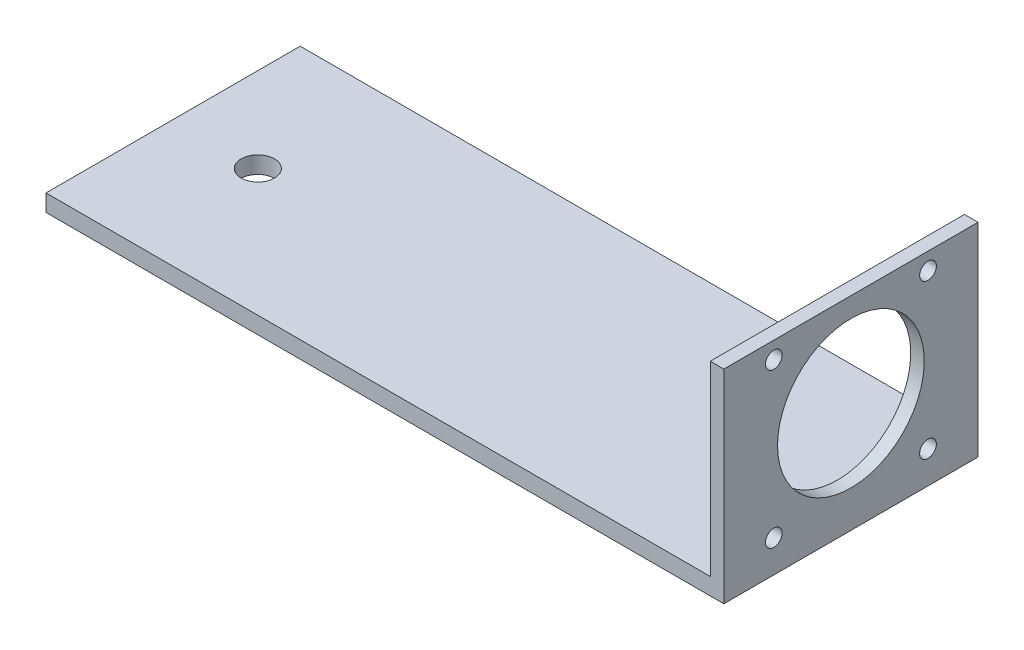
ISO-10303-21;
HEADER;
FILE_DESCRIPTION(('STEP AP214'),'2;1');
FILE_NAME('part.step','',(''),(''),'','','');
FILE_SCHEMA(('AUTOMOTIVE_DESIGN { 1 0 10303 214 1 1 1 1 }'));
ENDSEC;
DATA;
#1=APPLICATION_CONTEXT('core data for automotive mechanical design processes');
#2=APPLICATION_PROTOCOL_DEFINITION('international standard','automotive_design',2000,#1);
#3=PRODUCT_CONTEXT('',#1,'mechanical');
#4=PRODUCT('Part','Part','',(#3));
#5=PRODUCT_RELATED_PRODUCT_CATEGORY('part','',(#4));
#6=PRODUCT_DEFINITION_FORMATION('','',#4);
#7=PRODUCT_DEFINITION_CONTEXT('part definition',#1,'design');
#8=PRODUCT_DEFINITION('design','',#6,#7);
#9=PRODUCT_DEFINITION_SHAPE('','',#8);
#10=(LENGTH_UNIT() NAMED_UNIT(*) SI_UNIT(.MILLI.,.METRE.));
#11=(NAMED_UNIT(*) PLANE_ANGLE_UNIT() SI_UNIT($,.RADIAN.));
#12=(NAMED_UNIT(*) SI_UNIT($,.STERADIAN.) SOLID_ANGLE_UNIT());
#13=UNCERTAINTY_MEASURE_WITH_UNIT(LENGTH_MEASURE(1.E-05),#10,'distance_accuracy_value','');
#14=(GEOMETRIC_REPRESENTATION_CONTEXT(3) GLOBAL_UNCERTAINTY_ASSIGNED_CONTEXT((#13)) GLOBAL_UNIT_ASSIGNED_CONTEXT((#10,
#11,#12)) REPRESENTATION_CONTEXT('',''));
#15=CARTESIAN_POINT('',(0.,0.,0.));
#16=DIRECTION('',(0.,0.,1.));
#17=DIRECTION('',(1.,0.,0.));
#18=AXIS2_PLACEMENT_3D('',#15,#16,#17);
#19=CARTESIAN_POINT('',(0.,2.54,0.));
#20=DIRECTION('',(1.,0.,0.));
#21=DIRECTION('',(0.,0.,-1.));
#22=AXIS2_PLACEMENT_3D('',#19,#20,#21);
#23=PLANE('',#22);
#24=DIRECTION('',(0.,0.,1.));
#25=VECTOR('',#24,1.);
#26=CARTESIAN_POINT('',(0.,0.,0.));
#27=LINE('',#26,#25);
#28=CARTESIAN_POINT('',(0.,0.,-38.1));
#29=VERTEX_POINT('',#28);
#30=CARTESIAN_POINT('',(0.,0.,0.));
#31=VERTEX_POINT('',#30);
#32=EDGE_CURVE('E120',#29,#31,#27,.T.);
#33=ORIENTED_EDGE('',*,*,#32,.T.);
#34=DIRECTION('',(0.,-1.,0.));
#35=VECTOR('',#34,1.);
#36=CARTESIAN_POINT('',(0.,2.54,0.));
#37=LINE('',#36,#35);
#38=CARTESIAN_POINT('',(0.,2.54,0.));
#39=VERTEX_POINT('',#38);
#40=EDGE_CURVE('E11',#39,#31,#37,.T.);
#41=ORIENTED_EDGE('',*,*,#40,.F.);
#42=DIRECTION('',(0.,0.,1.));
#43=VECTOR('',#42,1.);
#44=CARTESIAN_POINT('',(0.,2.54,0.));
#45=LINE('',#44,#43);
#46=CARTESIAN_POINT('',(0.,2.54,-38.1));
#47=VERTEX_POINT('',#46);
#48=EDGE_CURVE('E121',#47,#39,#45,.T.);
#49=ORIENTED_EDGE('',*,*,#48,.F.);
#50=DIRECTION('',(0.,-1.,0.));
#51=VECTOR('',#50,1.);
#52=CARTESIAN_POINT('',(0.,2.54,-38.1));
#53=LINE('',#52,#51);
#54=EDGE_CURVE('E126',#47,#29,#53,.T.);
#55=ORIENTED_EDGE('',*,*,#54,.T.);
#56=EDGE_LOOP('',(#33,#41,#49,#55));
#57=FACE_BOUND('',#56,.T.);
#58=ADVANCED_FACE('F39',(#57),#23,.F.);
#59=CARTESIAN_POINT('',(0.,2.54,0.));
#60=DIRECTION('',(0.,0.,-1.));
#61=DIRECTION('',(-1.,0.,0.));
#62=AXIS2_PLACEMENT_3D('',#59,#60,#61);
#63=PLANE('',#62);
#64=DIRECTION('',(1.,0.,0.));
#65=VECTOR('',#64,1.);
#66=CARTESIAN_POINT('',(0.,0.,0.));
#67=LINE('',#66,#65);
#68=CARTESIAN_POINT('',(101.6,0.,0.));
#69=VERTEX_POINT('',#68);
#70=EDGE_CURVE('E129',#31,#69,#67,.T.);
#71=ORIENTED_EDGE('',*,*,#70,.T.);
#72=DIRECTION('',(0.,-1.,0.));
#73=VECTOR('',#72,1.);
#74=CARTESIAN_POINT('',(101.6,2.54,0.));
#75=LINE('',#74,#73);
#76=CARTESIAN_POINT('',(101.6,30.48,0.));
#77=VERTEX_POINT('',#76);
#78=EDGE_CURVE('E46',#77,#69,#75,.T.);
#79=ORIENTED_EDGE('',*,*,#78,.F.);
#80=DIRECTION('',(1.,0.,0.));
#81=VECTOR('',#80,1.);
#82=CARTESIAN_POINT('',(99.568,30.48,0.));
#83=LINE('',#82,#81);
#84=CARTESIAN_POINT('',(99.568,30.48,0.));
#85=VERTEX_POINT('',#84);
#86=EDGE_CURVE('E108',#85,#77,#83,.T.);
#87=ORIENTED_EDGE('',*,*,#86,.F.);
#88=DIRECTION('',(0.,-1.,0.));
#89=VECTOR('',#88,1.);
#90=CARTESIAN_POINT('',(99.568,0.,0.));
#91=LINE('',#90,#89);
#92=CARTESIAN_POINT('',(99.568,2.54,0.));
#93=VERTEX_POINT('',#92);
#94=EDGE_CURVE('E100',#85,#93,#91,.T.);
#95=ORIENTED_EDGE('',*,*,#94,.T.);
#96=DIRECTION('',(1.,0.,0.));
#97=VECTOR('',#96,1.);
#98=CARTESIAN_POINT('',(0.,2.54,0.));
#99=LINE('',#98,#97);
#100=EDGE_CURVE('E58',#39,#93,#99,.T.);
#101=ORIENTED_EDGE('',*,*,#100,.F.);
#102=ORIENTED_EDGE('',*,*,#40,.T.);
#103=EDGE_LOOP('',(#71,#79,#87,#95,#101,#102));
#104=FACE_BOUND('',#103,.T.);
#105=ADVANCED_FACE('F163',(#104),#63,.F.);
#106=CARTESIAN_POINT('',(101.6,2.54,0.));
#107=DIRECTION('',(-1.,0.,0.));
#108=DIRECTION('',(0.,0.,1.));
#109=AXIS2_PLACEMENT_3D('',#106,#107,#108);
#110=PLANE('',#109);
#111=CARTESIAN_POINT('',(101.6,4.826,-30.607));
#112=DIRECTION('',(-1.,0.,0.));
#113=DIRECTION('',(0.,0.,1.));
#114=AXIS2_PLACEMENT_3D('',#111,#112,#113);
#115=CIRCLE('',#114,1.24968);
#116=CARTESIAN_POINT('',(101.6,4.826,-29.35732));
#117=VERTEX_POINT('',#116);
#118=EDGE_CURVE('E192',#117,#117,#115,.F.);
#119=ORIENTED_EDGE('',*,*,#118,.F.);
#120=EDGE_LOOP('',(#119));
#121=FACE_BOUND('',#120,.T.);
#122=CARTESIAN_POINT('',(101.6,4.826,-7.493));
#123=DIRECTION('',(-1.,0.,0.));
#124=DIRECTION('',(0.,0.,1.));
#125=AXIS2_PLACEMENT_3D('',#122,#123,#124);
#126=CIRCLE('',#125,1.24968);
#127=CARTESIAN_POINT('',(101.6,4.826,-6.24332));
#128=VERTEX_POINT('',#127);
#129=EDGE_CURVE('E199',#128,#128,#126,.F.);
#130=ORIENTED_EDGE('',*,*,#129,.F.);
#131=EDGE_LOOP('',(#130));
#132=FACE_BOUND('',#131,.T.);
#133=CARTESIAN_POINT('',(101.6,27.94,-7.493));
#134=DIRECTION('',(-1.,0.,0.));
#135=DIRECTION('',(0.,0.,1.));
#136=AXIS2_PLACEMENT_3D('',#133,#134,#135);
#137=CIRCLE('',#136,1.24968);
#138=CARTESIAN_POINT('',(101.6,27.94,-6.24332));
#139=VERTEX_POINT('',#138);
#140=EDGE_CURVE('E191',#139,#139,#137,.F.);
#141=ORIENTED_EDGE('',*,*,#140,.F.);
#142=EDGE_LOOP('',(#141));
#143=FACE_BOUND('',#142,.T.);
#144=CARTESIAN_POINT('',(101.6,27.94,-30.607));
#145=DIRECTION('',(-1.,0.,0.));
#146=DIRECTION('',(0.,0.,1.));
#147=AXIS2_PLACEMENT_3D('',#144,#145,#146);
#148=CIRCLE('',#147,1.24968);
#149=CARTESIAN_POINT('',(101.6,27.94,-29.35732));
#150=VERTEX_POINT('',#149);
#151=EDGE_CURVE('E183',#150,#150,#148,.F.);
#152=ORIENTED_EDGE('',*,*,#151,.F.);
#153=EDGE_LOOP('',(#152));
#154=FACE_BOUND('',#153,.T.);
#155=CARTESIAN_POINT('',(101.6,16.51,-19.05));
#156=DIRECTION('',(-1.,0.,0.));
#157=DIRECTION('',(0.,0.,1.));
#158=AXIS2_PLACEMENT_3D('',#155,#156,#157);
#159=CIRCLE('',#158,10.9982);
#160=CARTESIAN_POINT('',(101.6,16.51,-8.0518));
#161=VERTEX_POINT('',#160);
#162=EDGE_CURVE('E117',#161,#161,#159,.T.);
#163=ORIENTED_EDGE('',*,*,#162,.T.);
#164=EDGE_LOOP('',(#163));
#165=FACE_BOUND('',#164,.T.);
#166=DIRECTION('',(0.,0.,-1.));
#167=VECTOR('',#166,1.);
#168=CARTESIAN_POINT('',(101.6,0.,0.));
#169=LINE('',#168,#167);
#170=CARTESIAN_POINT('',(101.6,0.,-38.1));
#171=VERTEX_POINT('',#170);
#172=EDGE_CURVE('E131',#69,#171,#169,.T.);
#173=ORIENTED_EDGE('',*,*,#172,.T.);
#174=DIRECTION('',(0.,-1.,0.));
#175=VECTOR('',#174,1.);
#176=CARTESIAN_POINT('',(101.6,2.54,-38.1));
#177=LINE('',#176,#175);
#178=CARTESIAN_POINT('',(101.6,30.48,-38.1));
#179=VERTEX_POINT('',#178);
#180=EDGE_CURVE('E136',#179,#171,#177,.T.);
#181=ORIENTED_EDGE('',*,*,#180,.F.);
#182=DIRECTION('',(0.,0.,1.));
#183=VECTOR('',#182,1.);
#184=CARTESIAN_POINT('',(101.6,30.48,0.));
#185=LINE('',#184,#183);
#186=EDGE_CURVE('E107',#179,#77,#185,.T.);
#187=ORIENTED_EDGE('',*,*,#186,.T.);
#188=ORIENTED_EDGE('',*,*,#78,.T.);
#189=EDGE_LOOP('',(#173,#181,#187,#188));
#190=FACE_BOUND('',#189,.T.);
#191=ADVANCED_FACE('F140',(#121,#132,#143,#154,#165,#190),#110,.F.);
#192=CARTESIAN_POINT('',(0.,2.54,-38.1));
#193=DIRECTION('',(0.,0.,1.));
#194=DIRECTION('',(1.,0.,0.));
#195=AXIS2_PLACEMENT_3D('',#192,#193,#194);
#196=PLANE('',#195);
#197=DIRECTION('',(-1.,0.,0.));
#198=VECTOR('',#197,1.);
#199=CARTESIAN_POINT('',(0.,2.54,-38.1));
#200=LINE('',#199,#198);
#201=CARTESIAN_POINT('',(99.568,2.54,-38.1));
#202=VERTEX_POINT('',#201);
#203=EDGE_CURVE('E96',#202,#47,#200,.T.);
#204=ORIENTED_EDGE('',*,*,#203,.F.);
#205=DIRECTION('',(0.,1.,0.));
#206=VECTOR('',#205,1.);
#207=CARTESIAN_POINT('',(99.568,0.,-38.1));
#208=LINE('',#207,#206);
#209=CARTESIAN_POINT('',(99.568,30.48,-38.1));
#210=VERTEX_POINT('',#209);
#211=EDGE_CURVE('E89',#202,#210,#208,.T.);
#212=ORIENTED_EDGE('',*,*,#211,.T.);
#213=DIRECTION('',(1.,0.,0.));
#214=VECTOR('',#213,1.);
#215=CARTESIAN_POINT('',(99.568,30.48,-38.1));
#216=LINE('',#215,#214);
#217=EDGE_CURVE('E93',#210,#179,#216,.T.);
#218=ORIENTED_EDGE('',*,*,#217,.T.);
#219=ORIENTED_EDGE('',*,*,#180,.T.);
#220=DIRECTION('',(-1.,0.,0.));
#221=VECTOR('',#220,1.);
#222=CARTESIAN_POINT('',(0.,0.,-38.1));
#223=LINE('',#222,#221);
#224=EDGE_CURVE('E123',#171,#29,#223,.T.);
#225=ORIENTED_EDGE('',*,*,#224,.T.);
#226=ORIENTED_EDGE('',*,*,#54,.F.);
#227=EDGE_LOOP('',(#204,#212,#218,#219,#225,#226));
#228=FACE_BOUND('',#227,.T.);
#229=ADVANCED_FACE('F91',(#228),#196,.F.);
#230=CARTESIAN_POINT('',(0.,2.54,0.));
#231=DIRECTION('',(0.,-1.,0.));
#232=DIRECTION('',(0.,0.,-1.));
#233=AXIS2_PLACEMENT_3D('',#230,#231,#232);
#234=PLANE('',#233);
#235=CARTESIAN_POINT('',(12.7,2.54,-19.05));
#236=DIRECTION('',(0.,1.,0.));
#237=DIRECTION('',(0.,0.,1.));
#238=AXIS2_PLACEMENT_3D('',#235,#236,#237);
#239=CIRCLE('',#238,2.5);
#240=CARTESIAN_POINT('',(12.7,2.54,-16.55));
#241=VERTEX_POINT('',#240);
#242=EDGE_CURVE('E180',#241,#241,#239,.T.);
#243=ORIENTED_EDGE('',*,*,#242,.F.);
#244=EDGE_LOOP('',(#243));
#245=FACE_BOUND('',#244,.T.);
#246=ORIENTED_EDGE('',*,*,#100,.T.);
#247=DIRECTION('',(0.,0.,-1.));
#248=VECTOR('',#247,1.);
#249=CARTESIAN_POINT('',(99.568,2.54,0.));
#250=LINE('',#249,#248);
#251=EDGE_CURVE('E53',#93,#202,#250,.T.);
#252=ORIENTED_EDGE('',*,*,#251,.T.);
#253=ORIENTED_EDGE('',*,*,#203,.T.);
#254=ORIENTED_EDGE('',*,*,#48,.T.);
#255=EDGE_LOOP('',(#246,#252,#253,#254));
#256=FACE_BOUND('',#255,.T.);
#257=ADVANCED_FACE('F149',(#245,#256),#234,.F.);
#258=CARTESIAN_POINT('',(0.,0.,0.));
#259=DIRECTION('',(0.,-1.,0.));
#260=DIRECTION('',(0.,0.,-1.));
#261=AXIS2_PLACEMENT_3D('',#258,#259,#260);
#262=PLANE('',#261);
#263=CARTESIAN_POINT('',(12.7,0.,-19.05));
#264=DIRECTION('',(0.,1.,0.));
#265=DIRECTION('',(0.,0.,1.));
#266=AXIS2_PLACEMENT_3D('',#263,#264,#265);
#267=CIRCLE('',#266,2.5);
#268=CARTESIAN_POINT('',(12.7,0.,-16.55));
#269=VERTEX_POINT('',#268);
#270=EDGE_CURVE('E177',#269,#269,#267,.T.);
#271=ORIENTED_EDGE('',*,*,#270,.T.);
#272=EDGE_LOOP('',(#271));
#273=FACE_BOUND('',#272,.T.);
#274=ORIENTED_EDGE('',*,*,#32,.F.);
#275=ORIENTED_EDGE('',*,*,#224,.F.);
#276=ORIENTED_EDGE('',*,*,#172,.F.);
#277=ORIENTED_EDGE('',*,*,#70,.F.);
#278=EDGE_LOOP('',(#274,#275,#276,#277));
#279=FACE_BOUND('',#278,.T.);
#280=ADVANCED_FACE('F145',(#273,#279),#262,.T.);
#281=CARTESIAN_POINT('',(99.568,0.,0.));
#282=DIRECTION('',(-1.,0.,0.));
#283=DIRECTION('',(0.,0.,1.));
#284=AXIS2_PLACEMENT_3D('',#281,#282,#283);
#285=PLANE('',#284);
#286=CARTESIAN_POINT('',(99.568,4.826,-30.607));
#287=DIRECTION('',(-1.,0.,0.));
#288=DIRECTION('',(0.,0.,1.));
#289=AXIS2_PLACEMENT_3D('',#286,#287,#288);
#290=CIRCLE('',#289,1.24968);
#291=CARTESIAN_POINT('',(99.568,4.826,-29.35732));
#292=VERTEX_POINT('',#291);
#293=EDGE_CURVE('E196',#292,#292,#290,.T.);
#294=ORIENTED_EDGE('',*,*,#293,.F.);
#295=EDGE_LOOP('',(#294));
#296=FACE_BOUND('',#295,.T.);
#297=CARTESIAN_POINT('',(99.568,4.826,-7.493));
#298=DIRECTION('',(-1.,0.,0.));
#299=DIRECTION('',(0.,0.,1.));
#300=AXIS2_PLACEMENT_3D('',#297,#298,#299);
#301=CIRCLE('',#300,1.24968);
#302=CARTESIAN_POINT('',(99.568,4.826,-6.24332));
#303=VERTEX_POINT('',#302);
#304=EDGE_CURVE('E195',#303,#303,#301,.T.);
#305=ORIENTED_EDGE('',*,*,#304,.F.);
#306=EDGE_LOOP('',(#305));
#307=FACE_BOUND('',#306,.T.);
#308=CARTESIAN_POINT('',(99.568,27.94,-7.493));
#309=DIRECTION('',(-1.,0.,0.));
#310=DIRECTION('',(0.,0.,1.));
#311=AXIS2_PLACEMENT_3D('',#308,#309,#310);
#312=CIRCLE('',#311,1.24968);
#313=CARTESIAN_POINT('',(99.568,27.94,-6.24332));
#314=VERTEX_POINT('',#313);
#315=EDGE_CURVE('E202',#314,#314,#312,.T.);
#316=ORIENTED_EDGE('',*,*,#315,.F.);
#317=EDGE_LOOP('',(#316));
#318=FACE_BOUND('',#317,.T.);
#319=CARTESIAN_POINT('',(99.568,27.94,-30.607));
#320=DIRECTION('',(-1.,0.,0.));
#321=DIRECTION('',(0.,0.,1.));
#322=AXIS2_PLACEMENT_3D('',#319,#320,#321);
#323=CIRCLE('',#322,1.24968);
#324=CARTESIAN_POINT('',(99.568,27.94,-29.35732));
#325=VERTEX_POINT('',#324);
#326=EDGE_CURVE('E188',#325,#325,#323,.T.);
#327=ORIENTED_EDGE('',*,*,#326,.F.);
#328=EDGE_LOOP('',(#327));
#329=FACE_BOUND('',#328,.T.);
#330=CARTESIAN_POINT('',(99.568,16.51,-19.05));
#331=DIRECTION('',(-1.,0.,0.));
#332=DIRECTION('',(0.,0.,1.));
#333=AXIS2_PLACEMENT_3D('',#330,#331,#332);
#334=CIRCLE('',#333,10.9982);
#335=CARTESIAN_POINT('',(99.568,16.51,-8.0518));
#336=VERTEX_POINT('',#335);
#337=EDGE_CURVE('E174',#336,#336,#334,.T.);
#338=ORIENTED_EDGE('',*,*,#337,.F.);
#339=EDGE_LOOP('',(#338));
#340=FACE_BOUND('',#339,.T.);
#341=ORIENTED_EDGE('',*,*,#251,.F.);
#342=ORIENTED_EDGE('',*,*,#94,.F.);
#343=DIRECTION('',(0.,0.,1.));
#344=VECTOR('',#343,1.);
#345=CARTESIAN_POINT('',(99.568,30.48,0.));
#346=LINE('',#345,#344);
#347=EDGE_CURVE('E99',#210,#85,#346,.T.);
#348=ORIENTED_EDGE('',*,*,#347,.F.);
#349=ORIENTED_EDGE('',*,*,#211,.F.);
#350=EDGE_LOOP('',(#341,#342,#348,#349));
#351=FACE_BOUND('',#350,.T.);
#352=ADVANCED_FACE('F111',(#296,#307,#318,#329,#340,#351),#285,.T.);
#353=CARTESIAN_POINT('',(99.568,30.48,0.));
#354=DIRECTION('',(0.,1.,0.));
#355=DIRECTION('',(0.,0.,1.));
#356=AXIS2_PLACEMENT_3D('',#353,#354,#355);
#357=PLANE('',#356);
#358=ORIENTED_EDGE('',*,*,#186,.F.);
#359=ORIENTED_EDGE('',*,*,#217,.F.);
#360=ORIENTED_EDGE('',*,*,#347,.T.);
#361=ORIENTED_EDGE('',*,*,#86,.T.);
#362=EDGE_LOOP('',(#358,#359,#360,#361));
#363=FACE_BOUND('',#362,.T.);
#364=ADVANCED_FACE('F104',(#363),#357,.T.);
#365=CARTESIAN_POINT('',(101.6,16.51,-19.05));
#366=DIRECTION('',(-1.,0.,0.));
#367=DIRECTION('',(0.,0.,1.));
#368=AXIS2_PLACEMENT_3D('',#365,#366,#367);
#369=CYLINDRICAL_SURFACE('',#368,10.9982);
#370=ORIENTED_EDGE('',*,*,#162,.F.);
#371=EDGE_LOOP('',(#370));
#372=FACE_BOUND('',#371,.T.);
#373=ORIENTED_EDGE('',*,*,#337,.T.);
#374=EDGE_LOOP('',(#373));
#375=FACE_BOUND('',#374,.T.);
#376=ADVANCED_FACE('F221',(#372,#375),#369,.F.);
#377=CARTESIAN_POINT('',(12.7,0.,-19.05));
#378=DIRECTION('',(0.,1.,0.));
#379=DIRECTION('',(0.,0.,1.));
#380=AXIS2_PLACEMENT_3D('',#377,#378,#379);
#381=CYLINDRICAL_SURFACE('',#380,2.5);
#382=ORIENTED_EDGE('',*,*,#270,.F.);
#383=EDGE_LOOP('',(#382));
#384=FACE_BOUND('',#383,.T.);
#385=ORIENTED_EDGE('',*,*,#242,.T.);
#386=EDGE_LOOP('',(#385));
#387=FACE_BOUND('',#386,.T.);
#388=ADVANCED_FACE('F223',(#384,#387),#381,.F.);
#389=CARTESIAN_POINT('',(101.601,27.94,-30.607));
#390=DIRECTION('',(-1.,0.,0.));
#391=DIRECTION('',(0.,0.,1.));
#392=AXIS2_PLACEMENT_3D('',#389,#390,#391);
#393=CYLINDRICAL_SURFACE('',#392,1.24968);
#394=ORIENTED_EDGE('',*,*,#326,.T.);
#395=EDGE_LOOP('',(#394));
#396=FACE_BOUND('',#395,.T.);
#397=ORIENTED_EDGE('',*,*,#151,.T.);
#398=EDGE_LOOP('',(#397));
#399=FACE_BOUND('',#398,.T.);
#400=ADVANCED_FACE('F230',(#396,#399),#393,.F.);
#401=CARTESIAN_POINT('',(101.601,27.94,-7.493));
#402=DIRECTION('',(-1.,0.,0.));
#403=DIRECTION('',(0.,0.,1.));
#404=AXIS2_PLACEMENT_3D('',#401,#402,#403);
#405=CYLINDRICAL_SURFACE('',#404,1.24968);
#406=ORIENTED_EDGE('',*,*,#315,.T.);
#407=EDGE_LOOP('',(#406));
#408=FACE_BOUND('',#407,.T.);
#409=ORIENTED_EDGE('',*,*,#140,.T.);
#410=EDGE_LOOP('',(#409));
#411=FACE_BOUND('',#410,.T.);
#412=ADVANCED_FACE('F210',(#408,#411),#405,.F.);
#413=CARTESIAN_POINT('',(101.601,4.826,-7.493));
#414=DIRECTION('',(-1.,0.,0.));
#415=DIRECTION('',(0.,0.,1.));
#416=AXIS2_PLACEMENT_3D('',#413,#414,#415);
#417=CYLINDRICAL_SURFACE('',#416,1.24968);
#418=ORIENTED_EDGE('',*,*,#304,.T.);
#419=EDGE_LOOP('',(#418));
#420=FACE_BOUND('',#419,.T.);
#421=ORIENTED_EDGE('',*,*,#129,.T.);
#422=EDGE_LOOP('',(#421));
#423=FACE_BOUND('',#422,.T.);
#424=ADVANCED_FACE('F241',(#420,#423),#417,.F.);
#425=CARTESIAN_POINT('',(101.601,4.826,-30.607));
#426=DIRECTION('',(-1.,0.,0.));
#427=DIRECTION('',(0.,0.,1.));
#428=AXIS2_PLACEMENT_3D('',#425,#426,#427);
#429=CYLINDRICAL_SURFACE('',#428,1.24968);
#430=ORIENTED_EDGE('',*,*,#293,.T.);
#431=EDGE_LOOP('',(#430));
#432=FACE_BOUND('',#431,.T.);
#433=ORIENTED_EDGE('',*,*,#118,.T.);
#434=EDGE_LOOP('',(#433));
#435=FACE_BOUND('',#434,.T.);
#436=ADVANCED_FACE('F238',(#432,#435),#429,.F.);
#437=CLOSED_SHELL('',(#58,#105,#191,#229,#257,#280,#352,#364,#376,#388,#400,#412,#424,#436));
#438=MANIFOLD_SOLID_BREP('B2',#437);
#439=ADVANCED_BREP_SHAPE_REPRESENTATION('',(#18,#438),#14);
#440=SHAPE_DEFINITION_REPRESENTATION(#9,#439);
ENDSEC;
END-ISO-10303-21;
